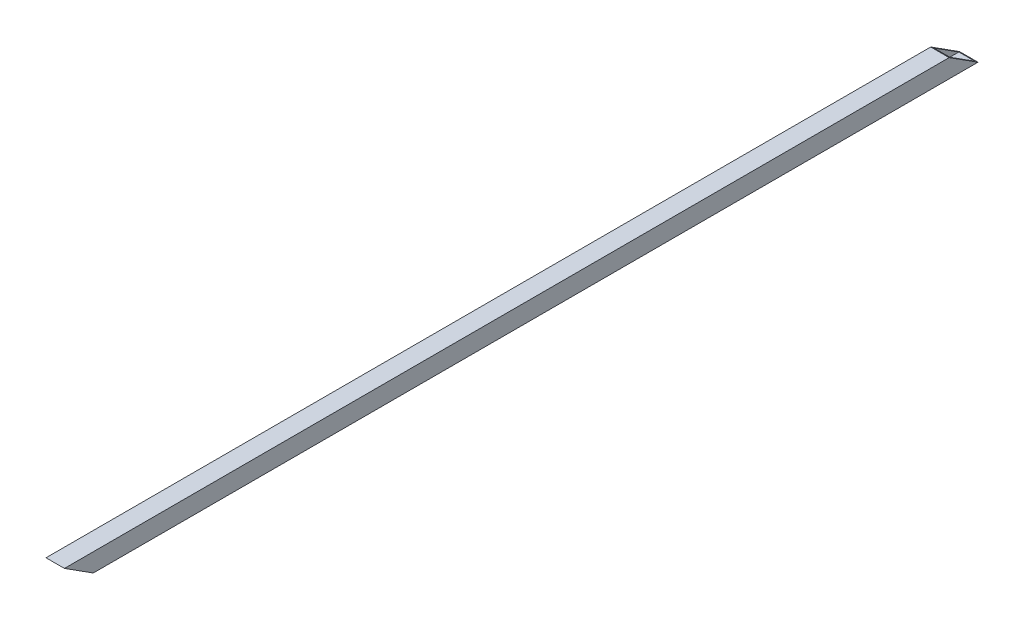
ISO-10303-21;
HEADER;
FILE_DESCRIPTION(('STEP AP214'),'2;1');
FILE_NAME('part.step','',(''),(''),'','','');
FILE_SCHEMA(('AUTOMOTIVE_DESIGN { 1 0 10303 214 1 1 1 1 }'));
ENDSEC;
DATA;
#1=APPLICATION_CONTEXT('core data for automotive mechanical design processes');
#2=APPLICATION_PROTOCOL_DEFINITION('international standard','automotive_design',2000,#1);
#3=PRODUCT_CONTEXT('',#1,'mechanical');
#4=PRODUCT('Part','Part','',(#3));
#5=PRODUCT_RELATED_PRODUCT_CATEGORY('part','',(#4));
#6=PRODUCT_DEFINITION_FORMATION('','',#4);
#7=PRODUCT_DEFINITION_CONTEXT('part definition',#1,'design');
#8=PRODUCT_DEFINITION('design','',#6,#7);
#9=PRODUCT_DEFINITION_SHAPE('','',#8);
#10=(LENGTH_UNIT() NAMED_UNIT(*) SI_UNIT(.MILLI.,.METRE.));
#11=(NAMED_UNIT(*) PLANE_ANGLE_UNIT() SI_UNIT($,.RADIAN.));
#12=(NAMED_UNIT(*) SI_UNIT($,.STERADIAN.) SOLID_ANGLE_UNIT());
#13=UNCERTAINTY_MEASURE_WITH_UNIT(LENGTH_MEASURE(1.E-05),#10,'distance_accuracy_value','');
#14=(GEOMETRIC_REPRESENTATION_CONTEXT(3) GLOBAL_UNCERTAINTY_ASSIGNED_CONTEXT((#13)) GLOBAL_UNIT_ASSIGNED_CONTEXT((#10,
#11,#12)) REPRESENTATION_CONTEXT('',''));
#15=CARTESIAN_POINT('',(0.,0.,0.));
#16=DIRECTION('',(0.,0.,1.));
#17=DIRECTION('',(1.,0.,0.));
#18=AXIS2_PLACEMENT_3D('',#15,#16,#17);
#19=CARTESIAN_POINT('',(-26.,26.,-60.));
#20=DIRECTION('',(1.,0.,0.));
#21=DIRECTION('',(0.,1.,0.));
#22=AXIS2_PLACEMENT_3D('',#19,#20,#21);
#23=PLANE('',#22);
#24=DIRECTION('',(0.,-0.537773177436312,-0.843089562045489));
#25=VECTOR('',#24,1.);
#26=CARTESIAN_POINT('',(-26.,-9.842128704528,-15.42991790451));
#27=LINE('',#26,#25);
#28=CARTESIAN_POINT('',(-26.,26.,40.761290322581));
#29=VERTEX_POINT('',#28);
#30=CARTESIAN_POINT('',(-26.,-26.,-40.76129032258));
#31=VERTEX_POINT('',#30);
#32=EDGE_CURVE('E110',#29,#31,#27,.T.);
#33=ORIENTED_EDGE('',*,*,#32,.F.);
#34=DIRECTION('',(0.,0.,1.));
#35=VECTOR('',#34,1.);
#36=CARTESIAN_POINT('',(-26.,26.,-60.));
#37=LINE('',#36,#35);
#38=CARTESIAN_POINT('',(-26.,26.,2923.017351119));
#39=VERTEX_POINT('',#38);
#40=EDGE_CURVE('E10',#29,#39,#37,.T.);
#41=ORIENTED_EDGE('',*,*,#40,.T.);
#42=DIRECTION('',(0.,0.537773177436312,0.843089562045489));
#43=VECTOR('',#42,1.);
#44=CARTESIAN_POINT('',(-26.,-1316.630949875,818.11850712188));
#45=LINE('',#44,#43);
#46=CARTESIAN_POINT('',(-26.,-26.,2841.494770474));
#47=VERTEX_POINT('',#46);
#48=EDGE_CURVE('E136',#47,#39,#45,.T.);
#49=ORIENTED_EDGE('',*,*,#48,.F.);
#50=DIRECTION('',(0.,0.,1.));
#51=VECTOR('',#50,1.);
#52=CARTESIAN_POINT('',(-26.,-26.,-60.));
#53=LINE('',#52,#51);
#54=EDGE_CURVE('E149',#31,#47,#53,.T.);
#55=ORIENTED_EDGE('',*,*,#54,.F.);
#56=EDGE_LOOP('',(#33,#41,#49,#55));
#57=FACE_BOUND('',#56,.T.);
#58=ADVANCED_FACE('F16',(#57),#23,.T.);
#59=CARTESIAN_POINT('',(26.,26.,-60.));
#60=DIRECTION('',(0.,-1.,0.));
#61=DIRECTION('',(0.,0.,-1.));
#62=AXIS2_PLACEMENT_3D('',#59,#60,#61);
#63=PLANE('',#62);
#64=DIRECTION('',(-1.,0.,0.));
#65=VECTOR('',#64,1.);
#66=CARTESIAN_POINT('',(13.,26.,40.761290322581));
#67=LINE('',#66,#65);
#68=CARTESIAN_POINT('',(26.,26.,40.761290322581));
#69=VERTEX_POINT('',#68);
#70=EDGE_CURVE('E104',#69,#29,#67,.T.);
#71=ORIENTED_EDGE('',*,*,#70,.F.);
#72=DIRECTION('',(0.,0.,1.));
#73=VECTOR('',#72,1.);
#74=CARTESIAN_POINT('',(26.,26.,-60.));
#75=LINE('',#74,#73);
#76=CARTESIAN_POINT('',(26.,26.,2923.017351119));
#77=VERTEX_POINT('',#76);
#78=EDGE_CURVE('E25',#69,#77,#75,.T.);
#79=ORIENTED_EDGE('',*,*,#78,.T.);
#80=DIRECTION('',(1.,0.,0.));
#81=VECTOR('',#80,1.);
#82=CARTESIAN_POINT('',(13.,26.,2923.017351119));
#83=LINE('',#82,#81);
#84=EDGE_CURVE('E140',#39,#77,#83,.T.);
#85=ORIENTED_EDGE('',*,*,#84,.F.);
#86=ORIENTED_EDGE('',*,*,#40,.F.);
#87=EDGE_LOOP('',(#71,#79,#85,#86));
#88=FACE_BOUND('',#87,.T.);
#89=ADVANCED_FACE('F105',(#88),#63,.T.);
#90=CARTESIAN_POINT('',(26.,-26.,-60.));
#91=DIRECTION('',(-1.,0.,0.));
#92=DIRECTION('',(0.,0.,1.));
#93=AXIS2_PLACEMENT_3D('',#90,#91,#92);
#94=PLANE('',#93);
#95=DIRECTION('',(0.,0.537773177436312,0.843089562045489));
#96=VECTOR('',#95,1.);
#97=CARTESIAN_POINT('',(26.,-17.36132845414,-27.21808267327));
#98=LINE('',#97,#96);
#99=CARTESIAN_POINT('',(26.,-26.,-40.76129032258));
#100=VERTEX_POINT('',#99);
#101=EDGE_CURVE('E98',#100,#69,#98,.T.);
#102=ORIENTED_EDGE('',*,*,#101,.F.);
#103=DIRECTION('',(0.,0.,1.));
#104=VECTOR('',#103,1.);
#105=CARTESIAN_POINT('',(26.,-26.,-60.));
#106=LINE('',#105,#104);
#107=CARTESIAN_POINT('',(26.,-26.,2841.494770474));
#108=VERTEX_POINT('',#107);
#109=EDGE_CURVE('E37',#100,#108,#106,.T.);
#110=ORIENTED_EDGE('',*,*,#109,.T.);
#111=DIRECTION('',(0.,-0.537773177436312,-0.843089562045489));
#112=VECTOR('',#111,1.);
#113=CARTESIAN_POINT('',(26.,-1324.150149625,806.33034235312));
#114=LINE('',#113,#112);
#115=EDGE_CURVE('E100',#77,#108,#114,.T.);
#116=ORIENTED_EDGE('',*,*,#115,.F.);
#117=ORIENTED_EDGE('',*,*,#78,.F.);
#118=EDGE_LOOP('',(#102,#110,#116,#117));
#119=FACE_BOUND('',#118,.T.);
#120=ADVANCED_FACE('F96',(#119),#94,.T.);
#121=CARTESIAN_POINT('',(-26.,-26.,-60.));
#122=DIRECTION('',(0.,1.,0.));
#123=DIRECTION('',(1.,0.,0.));
#124=AXIS2_PLACEMENT_3D('',#121,#122,#123);
#125=PLANE('',#124);
#126=DIRECTION('',(1.,0.,0.));
#127=VECTOR('',#126,1.);
#128=CARTESIAN_POINT('',(-13.,-26.,-40.76129032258));
#129=LINE('',#128,#127);
#130=EDGE_CURVE('E114',#31,#100,#129,.T.);
#131=ORIENTED_EDGE('',*,*,#130,.F.);
#132=ORIENTED_EDGE('',*,*,#54,.T.);
#133=DIRECTION('',(-1.,0.,0.));
#134=VECTOR('',#133,1.);
#135=CARTESIAN_POINT('',(-13.,-26.,2841.494770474));
#136=LINE('',#135,#134);
#137=EDGE_CURVE('E166',#108,#47,#136,.T.);
#138=ORIENTED_EDGE('',*,*,#137,.F.);
#139=ORIENTED_EDGE('',*,*,#109,.F.);
#140=EDGE_LOOP('',(#131,#132,#138,#139));
#141=FACE_BOUND('',#140,.T.);
#142=ADVANCED_FACE('F18',(#141),#125,.T.);
#143=CARTESIAN_POINT('',(30.,30.,-60.));
#144=DIRECTION('',(0.,-1.,0.));
#145=DIRECTION('',(0.,0.,-1.));
#146=AXIS2_PLACEMENT_3D('',#143,#144,#145);
#147=PLANE('',#146);
#148=DIRECTION('',(0.,0.,1.));
#149=VECTOR('',#148,1.);
#150=CARTESIAN_POINT('',(-30.,30.,-60.));
#151=LINE('',#150,#149);
#152=CARTESIAN_POINT('',(-30.,30.,47.032258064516));
#153=VERTEX_POINT('',#152);
#154=CARTESIAN_POINT('',(-30.,30.,2929.288318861));
#155=VERTEX_POINT('',#154);
#156=EDGE_CURVE('E70',#153,#155,#151,.T.);
#157=ORIENTED_EDGE('',*,*,#156,.T.);
#158=DIRECTION('',(1.,0.,0.));
#159=VECTOR('',#158,1.);
#160=CARTESIAN_POINT('',(15.,30.,2929.288318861));
#161=LINE('',#160,#159);
#162=CARTESIAN_POINT('',(30.,30.,2929.288318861));
#163=VERTEX_POINT('',#162);
#164=EDGE_CURVE('E82',#155,#163,#161,.T.);
#165=ORIENTED_EDGE('',*,*,#164,.T.);
#166=DIRECTION('',(0.,0.,1.));
#167=VECTOR('',#166,1.);
#168=CARTESIAN_POINT('',(30.,30.,-60.));
#169=LINE('',#168,#167);
#170=CARTESIAN_POINT('',(30.,30.,47.032258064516));
#171=VERTEX_POINT('',#170);
#172=EDGE_CURVE('E152',#171,#163,#169,.T.);
#173=ORIENTED_EDGE('',*,*,#172,.F.);
#174=DIRECTION('',(-1.,0.,0.));
#175=VECTOR('',#174,1.);
#176=CARTESIAN_POINT('',(15.,30.,47.032258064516));
#177=LINE('',#176,#175);
#178=EDGE_CURVE('E133',#171,#153,#177,.T.);
#179=ORIENTED_EDGE('',*,*,#178,.T.);
#180=EDGE_LOOP('',(#157,#165,#173,#179));
#181=FACE_BOUND('',#180,.T.);
#182=ADVANCED_FACE('F203',(#181),#147,.F.);
#183=CARTESIAN_POINT('',(-30.,30.,-60.));
#184=DIRECTION('',(1.,0.,0.));
#185=DIRECTION('',(0.,1.,0.));
#186=AXIS2_PLACEMENT_3D('',#183,#184,#185);
#187=PLANE('',#186);
#188=DIRECTION('',(0.,0.,1.));
#189=VECTOR('',#188,1.);
#190=CARTESIAN_POINT('',(-30.,-30.,-60.));
#191=LINE('',#190,#189);
#192=CARTESIAN_POINT('',(-30.,-30.,-47.03225806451));
#193=VERTEX_POINT('',#192);
#194=CARTESIAN_POINT('',(-30.,-30.,2835.223802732));
#195=VERTEX_POINT('',#194);
#196=EDGE_CURVE('E129',#193,#195,#191,.T.);
#197=ORIENTED_EDGE('',*,*,#196,.T.);
#198=DIRECTION('',(0.,0.537773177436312,0.843089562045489));
#199=VECTOR('',#198,1.);
#200=CARTESIAN_POINT('',(-30.,-1316.052549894,819.02528902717));
#201=LINE('',#200,#199);
#202=EDGE_CURVE('E141',#195,#155,#201,.T.);
#203=ORIENTED_EDGE('',*,*,#202,.T.);
#204=ORIENTED_EDGE('',*,*,#156,.F.);
#205=DIRECTION('',(0.,-0.537773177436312,-0.843089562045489));
#206=VECTOR('',#205,1.);
#207=CARTESIAN_POINT('',(-30.,-9.263728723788,-14.52313599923));
#208=LINE('',#207,#206);
#209=EDGE_CURVE('E116',#153,#193,#208,.T.);
#210=ORIENTED_EDGE('',*,*,#209,.T.);
#211=EDGE_LOOP('',(#197,#203,#204,#210));
#212=FACE_BOUND('',#211,.T.);
#213=ADVANCED_FACE('F197',(#212),#187,.F.);
#214=CARTESIAN_POINT('',(0.,-1306.78882117,833.5484250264));
#215=DIRECTION('',(0.,0.843089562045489,-0.537773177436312));
#216=DIRECTION('',(-1.,0.,0.));
#217=AXIS2_PLACEMENT_3D('',#214,#215,#216);
#218=PLANE('',#217);
#219=ORIENTED_EDGE('',*,*,#48,.T.);
#220=ORIENTED_EDGE('',*,*,#84,.T.);
#221=ORIENTED_EDGE('',*,*,#115,.T.);
#222=ORIENTED_EDGE('',*,*,#137,.T.);
#223=EDGE_LOOP('',(#219,#220,#221,#222));
#224=FACE_BOUND('',#223,.T.);
#225=ORIENTED_EDGE('',*,*,#164,.F.);
#226=ORIENTED_EDGE('',*,*,#202,.F.);
#227=DIRECTION('',(-1.,0.,0.));
#228=VECTOR('',#227,1.);
#229=CARTESIAN_POINT('',(-15.,-30.,2835.223802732));
#230=LINE('',#229,#228);
#231=CARTESIAN_POINT('',(30.,-30.,2835.223802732));
#232=VERTEX_POINT('',#231);
#233=EDGE_CURVE('E127',#232,#195,#230,.T.);
#234=ORIENTED_EDGE('',*,*,#233,.F.);
#235=DIRECTION('',(0.,-0.537773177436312,-0.843089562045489));
#236=VECTOR('',#235,1.);
#237=CARTESIAN_POINT('',(30.,-1324.728549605,805.42356044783));
#238=LINE('',#237,#236);
#239=EDGE_CURVE('E156',#163,#232,#238,.T.);
#240=ORIENTED_EDGE('',*,*,#239,.F.);
#241=EDGE_LOOP('',(#225,#226,#234,#240));
#242=FACE_BOUND('',#241,.T.);
#243=ADVANCED_FACE('F175',(#224,#242),#218,.F.);
#244=CARTESIAN_POINT('',(30.,-30.,-60.));
#245=DIRECTION('',(-1.,0.,0.));
#246=DIRECTION('',(0.,0.,1.));
#247=AXIS2_PLACEMENT_3D('',#244,#245,#246);
#248=PLANE('',#247);
#249=ORIENTED_EDGE('',*,*,#172,.T.);
#250=ORIENTED_EDGE('',*,*,#239,.T.);
#251=DIRECTION('',(0.,0.,1.));
#252=VECTOR('',#251,1.);
#253=CARTESIAN_POINT('',(30.,-30.,-60.));
#254=LINE('',#253,#252);
#255=CARTESIAN_POINT('',(30.,-30.,-47.03225806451));
#256=VERTEX_POINT('',#255);
#257=EDGE_CURVE('E297',#256,#232,#254,.T.);
#258=ORIENTED_EDGE('',*,*,#257,.F.);
#259=DIRECTION('',(0.,0.537773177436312,0.843089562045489));
#260=VECTOR('',#259,1.);
#261=CARTESIAN_POINT('',(30.,-17.93972843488,-28.12486457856));
#262=LINE('',#261,#260);
#263=EDGE_CURVE('E123',#256,#171,#262,.T.);
#264=ORIENTED_EDGE('',*,*,#263,.T.);
#265=EDGE_LOOP('',(#249,#250,#258,#264));
#266=FACE_BOUND('',#265,.T.);
#267=ADVANCED_FACE('F194',(#266),#248,.F.);
#268=CARTESIAN_POINT('',(0.,0.,0.));
#269=DIRECTION('',(0.,-0.843089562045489,0.537773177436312));
#270=DIRECTION('',(-1.,0.,0.));
#271=AXIS2_PLACEMENT_3D('',#268,#269,#270);
#272=PLANE('',#271);
#273=ORIENTED_EDGE('',*,*,#101,.T.);
#274=ORIENTED_EDGE('',*,*,#70,.T.);
#275=ORIENTED_EDGE('',*,*,#32,.T.);
#276=ORIENTED_EDGE('',*,*,#130,.T.);
#277=EDGE_LOOP('',(#273,#274,#275,#276));
#278=FACE_BOUND('',#277,.T.);
#279=ORIENTED_EDGE('',*,*,#178,.F.);
#280=ORIENTED_EDGE('',*,*,#263,.F.);
#281=DIRECTION('',(1.,0.,0.));
#282=VECTOR('',#281,1.);
#283=CARTESIAN_POINT('',(-15.,-30.,-47.03225806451));
#284=LINE('',#283,#282);
#285=EDGE_CURVE('E132',#193,#256,#284,.T.);
#286=ORIENTED_EDGE('',*,*,#285,.F.);
#287=ORIENTED_EDGE('',*,*,#209,.F.);
#288=EDGE_LOOP('',(#279,#280,#286,#287));
#289=FACE_BOUND('',#288,.T.);
#290=ADVANCED_FACE('F112',(#278,#289),#272,.F.);
#291=CARTESIAN_POINT('',(-30.,-30.,-60.));
#292=DIRECTION('',(0.,1.,0.));
#293=DIRECTION('',(1.,0.,0.));
#294=AXIS2_PLACEMENT_3D('',#291,#292,#293);
#295=PLANE('',#294);
#296=ORIENTED_EDGE('',*,*,#257,.T.);
#297=ORIENTED_EDGE('',*,*,#233,.T.);
#298=ORIENTED_EDGE('',*,*,#196,.F.);
#299=ORIENTED_EDGE('',*,*,#285,.T.);
#300=EDGE_LOOP('',(#296,#297,#298,#299));
#301=FACE_BOUND('',#300,.T.);
#302=ADVANCED_FACE('F188',(#301),#295,.F.);
#303=CLOSED_SHELL('',(#58,#89,#120,#142,#182,#213,#243,#267,#290,#302));
#304=MANIFOLD_SOLID_BREP('B1',#303);
#305=ADVANCED_BREP_SHAPE_REPRESENTATION('',(#18,#304),#14);
#306=SHAPE_DEFINITION_REPRESENTATION(#9,#305);
ENDSEC;
END-ISO-10303-21;
